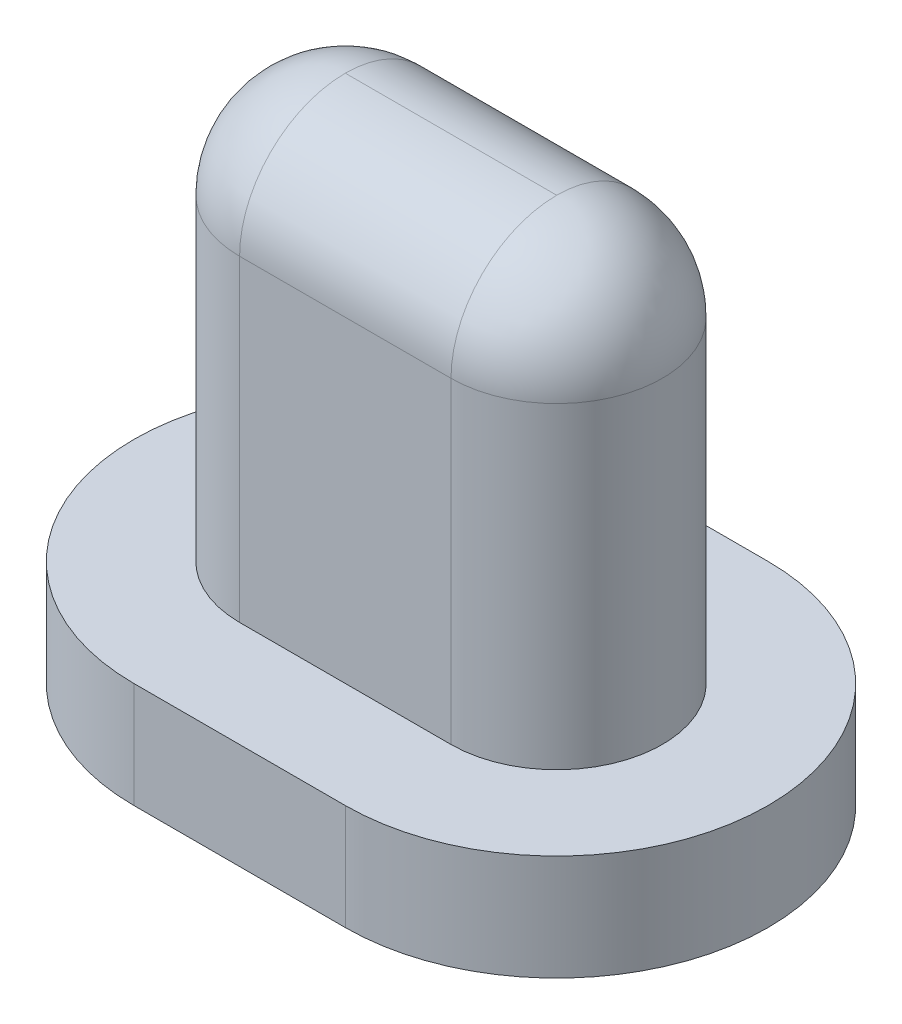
from build123d import *

# Parameters (mm, degrees)
BOSS_EXTRUDE1_DEPTH = 4
FILLET1_R           = 1
BOSS_EXTRUDE2_DEPTH = 1


with BuildPart() as part:
    # Sketch1 → Boss-Extrude1 (new body)
    with BuildSketch(Plane(origin=(0, 0, 0), x_dir=(1, 0, 0), z_dir=(0, 1, 0))):
        with BuildLine():
            Line((0, 1), (2, 1))
            ThreePointArc((2, 1), (3, 0), (2, -1))
            Line((2, -1), (0, -1))
            ThreePointArc((0, -1), (-1, 0), (0, 1))
        make_face()
    extrude(amount=BOSS_EXTRUDE1_DEPTH)

    # Fillet1
    fillet1_edges = [part.edges().sort_by_distance(p)[0] for p in [
        (3, 4, 0),
        (1, 4, -1),
        (-1, 4, 0),
        (1, 4, 1),
    ]]
    fillet(fillet1_edges, radius=FILLET1_R)

    # Sketch2 → Boss-Extrude2 (add)
    with BuildSketch(Plane.XZ):
        with BuildLine():
            Line((0, -2), (2, -2))
            ThreePointArc((2, -2), (4, 0), (2, 2))
            Line((2, 2), (0, 2))
            ThreePointArc((0, 2), (-2, 0), (0, -2))
        make_face()
    extrude(amount=BOSS_EXTRUDE2_DEPTH)


solid = part.part
